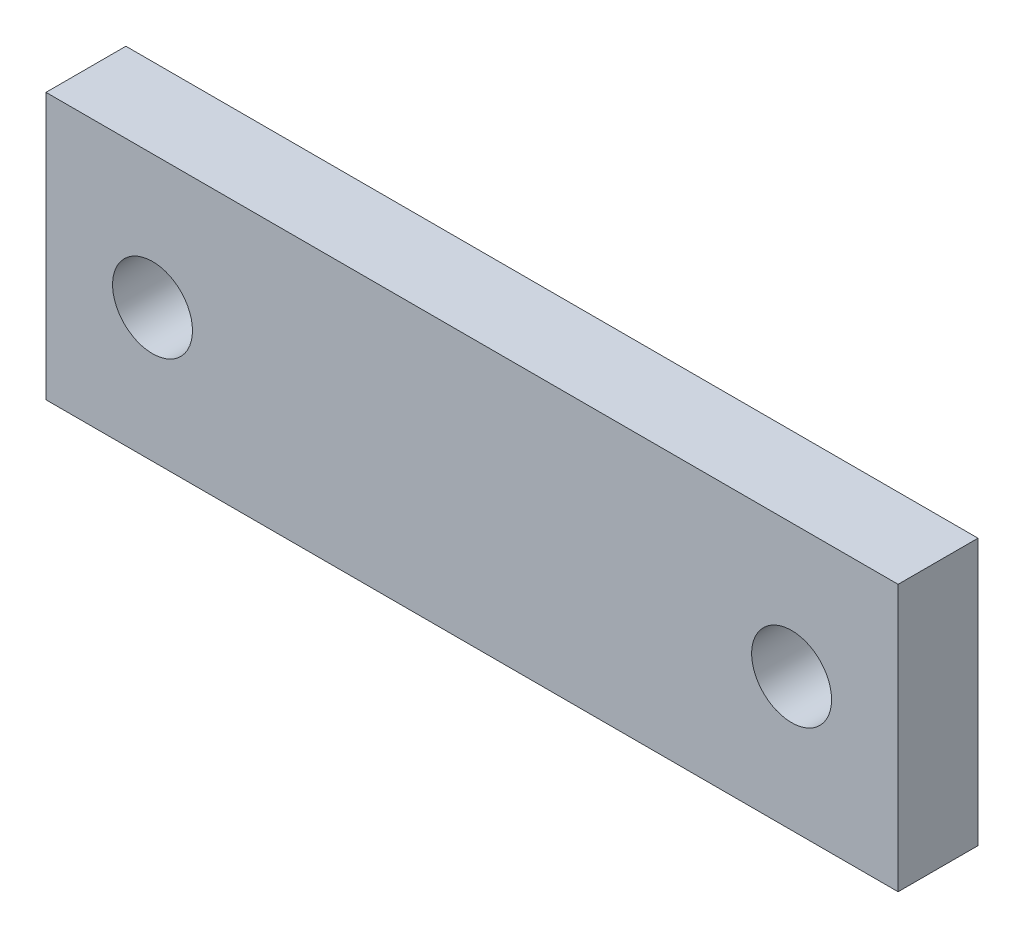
ISO-10303-21;
HEADER;
FILE_DESCRIPTION(('STEP AP214'),'2;1');
FILE_NAME('part.step','',(''),(''),'','','');
FILE_SCHEMA(('AUTOMOTIVE_DESIGN { 1 0 10303 214 1 1 1 1 }'));
ENDSEC;
DATA;
#1=APPLICATION_CONTEXT('core data for automotive mechanical design processes');
#2=APPLICATION_PROTOCOL_DEFINITION('international standard','automotive_design',2000,#1);
#3=PRODUCT_CONTEXT('',#1,'mechanical');
#4=PRODUCT('Part','Part','',(#3));
#5=PRODUCT_RELATED_PRODUCT_CATEGORY('part','',(#4));
#6=PRODUCT_DEFINITION_FORMATION('','',#4);
#7=PRODUCT_DEFINITION_CONTEXT('part definition',#1,'design');
#8=PRODUCT_DEFINITION('design','',#6,#7);
#9=PRODUCT_DEFINITION_SHAPE('','',#8);
#10=(LENGTH_UNIT() NAMED_UNIT(*) SI_UNIT(.MILLI.,.METRE.));
#11=(NAMED_UNIT(*) PLANE_ANGLE_UNIT() SI_UNIT($,.RADIAN.));
#12=(NAMED_UNIT(*) SI_UNIT($,.STERADIAN.) SOLID_ANGLE_UNIT());
#13=UNCERTAINTY_MEASURE_WITH_UNIT(LENGTH_MEASURE(1.E-05),#10,'distance_accuracy_value','');
#14=(GEOMETRIC_REPRESENTATION_CONTEXT(3) GLOBAL_UNCERTAINTY_ASSIGNED_CONTEXT((#13)) GLOBAL_UNIT_ASSIGNED_CONTEXT((#10,
#11,#12)) REPRESENTATION_CONTEXT('',''));
#15=CARTESIAN_POINT('',(0.,0.,0.));
#16=DIRECTION('',(0.,0.,1.));
#17=DIRECTION('',(1.,0.,0.));
#18=AXIS2_PLACEMENT_3D('',#15,#16,#17);
#19=CARTESIAN_POINT('',(0.,0.,-4.7625));
#20=DIRECTION('',(-1.,0.,0.));
#21=DIRECTION('',(0.,0.,1.));
#22=AXIS2_PLACEMENT_3D('',#19,#20,#21);
#23=PLANE('',#22);
#24=DIRECTION('',(0.,-1.,0.));
#25=VECTOR('',#24,1.);
#26=CARTESIAN_POINT('',(0.,0.,4.7625));
#27=LINE('',#26,#25);
#28=CARTESIAN_POINT('',(0.,31.75,4.7625));
#29=VERTEX_POINT('',#28);
#30=CARTESIAN_POINT('',(0.,0.,4.7625));
#31=VERTEX_POINT('',#30);
#32=EDGE_CURVE('E71',#29,#31,#27,.T.);
#33=ORIENTED_EDGE('',*,*,#32,.F.);
#34=DIRECTION('',(0.,0.,1.));
#35=VECTOR('',#34,1.);
#36=CARTESIAN_POINT('',(0.,31.75,-4.7625));
#37=LINE('',#36,#35);
#38=CARTESIAN_POINT('',(0.,31.75,-4.7625));
#39=VERTEX_POINT('',#38);
#40=EDGE_CURVE('E11',#39,#29,#37,.T.);
#41=ORIENTED_EDGE('',*,*,#40,.F.);
#42=DIRECTION('',(0.,-1.,0.));
#43=VECTOR('',#42,1.);
#44=CARTESIAN_POINT('',(0.,0.,-4.7625));
#45=LINE('',#44,#43);
#46=CARTESIAN_POINT('',(0.,0.,-4.7625));
#47=VERTEX_POINT('',#46);
#48=EDGE_CURVE('E73',#39,#47,#45,.T.);
#49=ORIENTED_EDGE('',*,*,#48,.T.);
#50=DIRECTION('',(0.,0.,1.));
#51=VECTOR('',#50,1.);
#52=CARTESIAN_POINT('',(0.,0.,-4.7625));
#53=LINE('',#52,#51);
#54=EDGE_CURVE('E34',#47,#31,#53,.T.);
#55=ORIENTED_EDGE('',*,*,#54,.T.);
#56=EDGE_LOOP('',(#33,#41,#49,#55));
#57=FACE_BOUND('',#56,.T.);
#58=ADVANCED_FACE('F31',(#57),#23,.T.);
#59=CARTESIAN_POINT('',(0.,31.75,-4.7625));
#60=DIRECTION('',(0.,1.,0.));
#61=DIRECTION('',(0.,0.,1.));
#62=AXIS2_PLACEMENT_3D('',#59,#60,#61);
#63=PLANE('',#62);
#64=DIRECTION('',(-1.,0.,0.));
#65=VECTOR('',#64,1.);
#66=CARTESIAN_POINT('',(0.,31.75,4.7625));
#67=LINE('',#66,#65);
#68=CARTESIAN_POINT('',(101.6,31.75,4.7625));
#69=VERTEX_POINT('',#68);
#70=EDGE_CURVE('E88',#69,#29,#67,.T.);
#71=ORIENTED_EDGE('',*,*,#70,.F.);
#72=DIRECTION('',(0.,0.,1.));
#73=VECTOR('',#72,1.);
#74=CARTESIAN_POINT('',(101.6,31.75,-4.7625));
#75=LINE('',#74,#73);
#76=CARTESIAN_POINT('',(101.6,31.75,-4.7625));
#77=VERTEX_POINT('',#76);
#78=EDGE_CURVE('E39',#77,#69,#75,.T.);
#79=ORIENTED_EDGE('',*,*,#78,.F.);
#80=DIRECTION('',(-1.,0.,0.));
#81=VECTOR('',#80,1.);
#82=CARTESIAN_POINT('',(0.,31.75,-4.7625));
#83=LINE('',#82,#81);
#84=EDGE_CURVE('E78',#77,#39,#83,.T.);
#85=ORIENTED_EDGE('',*,*,#84,.T.);
#86=ORIENTED_EDGE('',*,*,#40,.T.);
#87=EDGE_LOOP('',(#71,#79,#85,#86));
#88=FACE_BOUND('',#87,.T.);
#89=ADVANCED_FACE('F108',(#88),#63,.T.);
#90=CARTESIAN_POINT('',(101.6,0.,-4.7625));
#91=DIRECTION('',(1.,0.,0.));
#92=DIRECTION('',(0.,0.,-1.));
#93=AXIS2_PLACEMENT_3D('',#90,#91,#92);
#94=PLANE('',#93);
#95=DIRECTION('',(0.,1.,0.));
#96=VECTOR('',#95,1.);
#97=CARTESIAN_POINT('',(101.6,0.,4.7625));
#98=LINE('',#97,#96);
#99=CARTESIAN_POINT('',(101.6,0.,4.7625));
#100=VERTEX_POINT('',#99);
#101=EDGE_CURVE('E85',#100,#69,#98,.T.);
#102=ORIENTED_EDGE('',*,*,#101,.F.);
#103=DIRECTION('',(0.,0.,1.));
#104=VECTOR('',#103,1.);
#105=CARTESIAN_POINT('',(101.6,0.,-4.7625));
#106=LINE('',#105,#104);
#107=CARTESIAN_POINT('',(101.6,0.,-4.7625));
#108=VERTEX_POINT('',#107);
#109=EDGE_CURVE('E77',#108,#100,#106,.T.);
#110=ORIENTED_EDGE('',*,*,#109,.F.);
#111=DIRECTION('',(0.,1.,0.));
#112=VECTOR('',#111,1.);
#113=CARTESIAN_POINT('',(101.6,0.,-4.7625));
#114=LINE('',#113,#112);
#115=EDGE_CURVE('E101',#108,#77,#114,.T.);
#116=ORIENTED_EDGE('',*,*,#115,.T.);
#117=ORIENTED_EDGE('',*,*,#78,.T.);
#118=EDGE_LOOP('',(#102,#110,#116,#117));
#119=FACE_BOUND('',#118,.T.);
#120=ADVANCED_FACE('F105',(#119),#94,.T.);
#121=CARTESIAN_POINT('',(0.,0.,-4.7625));
#122=DIRECTION('',(0.,-1.,0.));
#123=DIRECTION('',(0.,0.,-1.));
#124=AXIS2_PLACEMENT_3D('',#121,#122,#123);
#125=PLANE('',#124);
#126=DIRECTION('',(1.,0.,0.));
#127=VECTOR('',#126,1.);
#128=CARTESIAN_POINT('',(0.,0.,4.7625));
#129=LINE('',#128,#127);
#130=EDGE_CURVE('E80',#31,#100,#129,.T.);
#131=ORIENTED_EDGE('',*,*,#130,.F.);
#132=ORIENTED_EDGE('',*,*,#54,.F.);
#133=DIRECTION('',(1.,0.,0.));
#134=VECTOR('',#133,1.);
#135=CARTESIAN_POINT('',(0.,0.,-4.7625));
#136=LINE('',#135,#134);
#137=EDGE_CURVE('E99',#47,#108,#136,.T.);
#138=ORIENTED_EDGE('',*,*,#137,.T.);
#139=ORIENTED_EDGE('',*,*,#109,.T.);
#140=EDGE_LOOP('',(#131,#132,#138,#139));
#141=FACE_BOUND('',#140,.T.);
#142=ADVANCED_FACE('F81',(#141),#125,.T.);
#143=CARTESIAN_POINT('',(0.,31.75,-4.7625));
#144=DIRECTION('',(0.,0.,-1.));
#145=DIRECTION('',(-1.,0.,0.));
#146=AXIS2_PLACEMENT_3D('',#143,#144,#145);
#147=PLANE('',#146);
#148=CARTESIAN_POINT('',(88.9,15.875,-4.7625));
#149=DIRECTION('',(0.,0.,1.));
#150=DIRECTION('',(1.,0.,0.));
#151=AXIS2_PLACEMENT_3D('',#148,#149,#150);
#152=CIRCLE('',#151,4.7625);
#153=CARTESIAN_POINT('',(93.6625,15.875,-4.7625));
#154=VERTEX_POINT('',#153);
#155=EDGE_CURVE('E173',#154,#154,#152,.T.);
#156=ORIENTED_EDGE('',*,*,#155,.T.);
#157=EDGE_LOOP('',(#156));
#158=FACE_BOUND('',#157,.T.);
#159=CARTESIAN_POINT('',(12.7,15.875,-4.7625));
#160=DIRECTION('',(0.,0.,1.));
#161=DIRECTION('',(1.,0.,0.));
#162=AXIS2_PLACEMENT_3D('',#159,#160,#161);
#163=CIRCLE('',#162,4.7625);
#164=CARTESIAN_POINT('',(17.4625,15.875,-4.7625));
#165=VERTEX_POINT('',#164);
#166=EDGE_CURVE('E89',#165,#165,#163,.T.);
#167=ORIENTED_EDGE('',*,*,#166,.T.);
#168=EDGE_LOOP('',(#167));
#169=FACE_BOUND('',#168,.T.);
#170=ORIENTED_EDGE('',*,*,#48,.F.);
#171=ORIENTED_EDGE('',*,*,#84,.F.);
#172=ORIENTED_EDGE('',*,*,#115,.F.);
#173=ORIENTED_EDGE('',*,*,#137,.F.);
#174=EDGE_LOOP('',(#170,#171,#172,#173));
#175=FACE_BOUND('',#174,.T.);
#176=ADVANCED_FACE('F110',(#158,#169,#175),#147,.T.);
#177=CARTESIAN_POINT('',(0.,31.75,4.7625));
#178=DIRECTION('',(0.,0.,-1.));
#179=DIRECTION('',(-1.,0.,0.));
#180=AXIS2_PLACEMENT_3D('',#177,#178,#179);
#181=PLANE('',#180);
#182=CARTESIAN_POINT('',(88.9,15.875,4.7625));
#183=DIRECTION('',(0.,0.,1.));
#184=DIRECTION('',(1.,0.,0.));
#185=AXIS2_PLACEMENT_3D('',#182,#183,#184);
#186=CIRCLE('',#185,4.7625);
#187=CARTESIAN_POINT('',(93.6625,15.875,4.7625));
#188=VERTEX_POINT('',#187);
#189=EDGE_CURVE('E176',#188,#188,#186,.T.);
#190=ORIENTED_EDGE('',*,*,#189,.F.);
#191=EDGE_LOOP('',(#190));
#192=FACE_BOUND('',#191,.T.);
#193=CARTESIAN_POINT('',(12.7,15.875,4.7625));
#194=DIRECTION('',(0.,0.,1.));
#195=DIRECTION('',(1.,0.,0.));
#196=AXIS2_PLACEMENT_3D('',#193,#194,#195);
#197=CIRCLE('',#196,4.7625);
#198=CARTESIAN_POINT('',(17.4625,15.875,4.7625));
#199=VERTEX_POINT('',#198);
#200=EDGE_CURVE('E92',#199,#199,#197,.T.);
#201=ORIENTED_EDGE('',*,*,#200,.F.);
#202=EDGE_LOOP('',(#201));
#203=FACE_BOUND('',#202,.T.);
#204=ORIENTED_EDGE('',*,*,#32,.T.);
#205=ORIENTED_EDGE('',*,*,#130,.T.);
#206=ORIENTED_EDGE('',*,*,#101,.T.);
#207=ORIENTED_EDGE('',*,*,#70,.T.);
#208=EDGE_LOOP('',(#204,#205,#206,#207));
#209=FACE_BOUND('',#208,.T.);
#210=ADVANCED_FACE('F87',(#192,#203,#209),#181,.F.);
#211=CARTESIAN_POINT('',(12.7,15.875,-4.7625));
#212=DIRECTION('',(0.,0.,1.));
#213=DIRECTION('',(1.,0.,0.));
#214=AXIS2_PLACEMENT_3D('',#211,#212,#213);
#215=CYLINDRICAL_SURFACE('',#214,4.7625);
#216=CARTESIAN_POINT('',(17.4625,15.875,-4.7625));
#217=CARTESIAN_POINT('',(17.4625,15.875,-4.66328125));
#218=CARTESIAN_POINT('',(17.4625,15.875,-4.5640625));
#219=CARTESIAN_POINT('',(17.4625,15.875,-4.365625));
#220=CARTESIAN_POINT('',(17.4625,15.875,-4.26640625));
#221=CARTESIAN_POINT('',(17.4625,15.875,-4.06796875));
#222=CARTESIAN_POINT('',(17.4625,15.875,-3.96875));
#223=CARTESIAN_POINT('',(17.4625,15.875,-3.7703125));
#224=CARTESIAN_POINT('',(17.4625,15.875,-3.67109375));
#225=CARTESIAN_POINT('',(17.4625,15.875,-3.47265625));
#226=CARTESIAN_POINT('',(17.4625,15.875,-3.3734375));
#227=CARTESIAN_POINT('',(17.4625,15.875,-3.175));
#228=CARTESIAN_POINT('',(17.4625,15.875,-3.07578125));
#229=CARTESIAN_POINT('',(17.4625,15.875,-2.87734375));
#230=CARTESIAN_POINT('',(17.4625,15.875,-2.778125));
#231=CARTESIAN_POINT('',(17.4625,15.875,-2.5796875));
#232=CARTESIAN_POINT('',(17.4625,15.875,-2.48046875));
#233=CARTESIAN_POINT('',(17.4625,15.875,-2.28203125));
#234=CARTESIAN_POINT('',(17.4625,15.875,-2.1828125));
#235=CARTESIAN_POINT('',(17.4625,15.875,-1.984375));
#236=CARTESIAN_POINT('',(17.4625,15.875,-1.88515625));
#237=CARTESIAN_POINT('',(17.4625,15.875,-1.68671875));
#238=CARTESIAN_POINT('',(17.4625,15.875,-1.5875));
#239=CARTESIAN_POINT('',(17.4625,15.875,-1.3890625));
#240=CARTESIAN_POINT('',(17.4625,15.875,-1.28984375));
#241=CARTESIAN_POINT('',(17.4625,15.875,-1.09140625));
#242=CARTESIAN_POINT('',(17.4625,15.875,-0.9921875));
#243=CARTESIAN_POINT('',(17.4625,15.875,-0.79375));
#244=CARTESIAN_POINT('',(17.4625,15.875,-0.69453125));
#245=CARTESIAN_POINT('',(17.4625,15.875,-0.49609375));
#246=CARTESIAN_POINT('',(17.4625,15.875,-0.396875));
#247=CARTESIAN_POINT('',(17.4625,15.875,-0.1984375));
#248=CARTESIAN_POINT('',(17.4625,15.875,-0.0992187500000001));
#249=CARTESIAN_POINT('',(17.4625,15.875,0.0992187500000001));
#250=CARTESIAN_POINT('',(17.4625,15.875,0.1984375));
#251=CARTESIAN_POINT('',(17.4625,15.875,0.396875));
#252=CARTESIAN_POINT('',(17.4625,15.875,0.49609375));
#253=CARTESIAN_POINT('',(17.4625,15.875,0.69453125));
#254=CARTESIAN_POINT('',(17.4625,15.875,0.793750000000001));
#255=CARTESIAN_POINT('',(17.4625,15.875,0.992187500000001));
#256=CARTESIAN_POINT('',(17.4625,15.875,1.09140625));
#257=CARTESIAN_POINT('',(17.4625,15.875,1.28984375));
#258=CARTESIAN_POINT('',(17.4625,15.875,1.3890625));
#259=CARTESIAN_POINT('',(17.4625,15.875,1.5875));
#260=CARTESIAN_POINT('',(17.4625,15.875,1.68671875));
#261=CARTESIAN_POINT('',(17.4625,15.875,1.88515625));
#262=CARTESIAN_POINT('',(17.4625,15.875,1.984375));
#263=CARTESIAN_POINT('',(17.4625,15.875,2.1828125));
#264=CARTESIAN_POINT('',(17.4625,15.875,2.28203125));
#265=CARTESIAN_POINT('',(17.4625,15.875,2.48046875));
#266=CARTESIAN_POINT('',(17.4625,15.875,2.5796875));
#267=CARTESIAN_POINT('',(17.4625,15.875,2.778125));
#268=CARTESIAN_POINT('',(17.4625,15.875,2.87734375));
#269=CARTESIAN_POINT('',(17.4625,15.875,3.07578125));
#270=CARTESIAN_POINT('',(17.4625,15.875,3.175));
#271=CARTESIAN_POINT('',(17.4625,15.875,3.3734375));
#272=CARTESIAN_POINT('',(17.4625,15.875,3.47265625));
#273=CARTESIAN_POINT('',(17.4625,15.875,3.67109375));
#274=CARTESIAN_POINT('',(17.4625,15.875,3.7703125));
#275=CARTESIAN_POINT('',(17.4625,15.875,3.96875));
#276=CARTESIAN_POINT('',(17.4625,15.875,4.06796875));
#277=CARTESIAN_POINT('',(17.4625,15.875,4.26640625));
#278=CARTESIAN_POINT('',(17.4625,15.875,4.365625));
#279=CARTESIAN_POINT('',(17.4625,15.875,4.5640625));
#280=CARTESIAN_POINT('',(17.4625,15.875,4.66328125));
#281=CARTESIAN_POINT('',(17.4625,15.875,4.7625));
#282=B_SPLINE_CURVE_WITH_KNOTS('',3,(#216,#217,#218,#219,#220,#221,#222,#223,#224,#225,#226,
#227,#228,#229,#230,#231,#232,#233,#234,#235,#236,#237,#238,#239,#240,#241,#242,#243,#244,#245,
#246,#247,#248,#249,#250,#251,#252,#253,#254,#255,#256,#257,#258,#259,#260,#261,#262,#263,#264,
#265,#266,#267,#268,#269,#270,#271,#272,#273,#274,#275,#276,#277,#278,#279,#280,#281),
.UNSPECIFIED.,.F.,.F.,(4,2,2,2,2,2,2,2,2,2,2,2,2,2,2,2,2,2,2,2,2,2,2,2,2,2,2,2,2,2,2,2,4),(0.,
0.297656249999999,0.595312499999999,0.89296875,1.190625,1.48828125,1.7859375,2.08359375,2.38125,
2.67890625,2.9765625,3.27421875,3.571875,3.86953125,4.1671875,4.46484375,4.7625,5.06015625,
5.3578125,5.65546875,5.953125,6.25078125,6.5484375,6.84609375,7.14375,7.44140625,7.7390625,
8.03671875,8.334375,8.63203125,8.9296875,9.22734375,9.525),.UNSPECIFIED.);
#283=EDGE_CURVE('BSEAM118',#165,#199,#282,.T.);
#284=ORIENTED_EDGE('',*,*,#166,.F.);
#285=ORIENTED_EDGE('',*,*,#200,.T.);
#286=ORIENTED_EDGE('',*,*,#283,.T.);
#287=ORIENTED_EDGE('',*,*,#283,.F.);
#288=EDGE_LOOP('',(#284,#286,#285,#287));
#289=FACE_BOUND('',#288,.T.);
#290=ADVANCED_FACE('F118',(#289),#215,.F.);
#291=CARTESIAN_POINT('',(88.9,15.875,-4.7625));
#292=DIRECTION('',(0.,0.,1.));
#293=DIRECTION('',(1.,0.,0.));
#294=AXIS2_PLACEMENT_3D('',#291,#292,#293);
#295=CYLINDRICAL_SURFACE('',#294,4.7625);
#296=CARTESIAN_POINT('',(93.6625,15.875,-4.7625));
#297=CARTESIAN_POINT('',(93.6625,15.875,-4.66328125));
#298=CARTESIAN_POINT('',(93.6625,15.875,-4.5640625));
#299=CARTESIAN_POINT('',(93.6625,15.875,-4.365625));
#300=CARTESIAN_POINT('',(93.6625,15.875,-4.26640625));
#301=CARTESIAN_POINT('',(93.6625,15.875,-4.06796875));
#302=CARTESIAN_POINT('',(93.6625,15.875,-3.96875));
#303=CARTESIAN_POINT('',(93.6625,15.875,-3.7703125));
#304=CARTESIAN_POINT('',(93.6625,15.875,-3.67109375));
#305=CARTESIAN_POINT('',(93.6625,15.875,-3.47265625));
#306=CARTESIAN_POINT('',(93.6625,15.875,-3.3734375));
#307=CARTESIAN_POINT('',(93.6625,15.875,-3.175));
#308=CARTESIAN_POINT('',(93.6625,15.875,-3.07578125));
#309=CARTESIAN_POINT('',(93.6625,15.875,-2.87734375));
#310=CARTESIAN_POINT('',(93.6625,15.875,-2.778125));
#311=CARTESIAN_POINT('',(93.6625,15.875,-2.5796875));
#312=CARTESIAN_POINT('',(93.6625,15.875,-2.48046875));
#313=CARTESIAN_POINT('',(93.6625,15.875,-2.28203125));
#314=CARTESIAN_POINT('',(93.6625,15.875,-2.1828125));
#315=CARTESIAN_POINT('',(93.6625,15.875,-1.984375));
#316=CARTESIAN_POINT('',(93.6625,15.875,-1.88515625));
#317=CARTESIAN_POINT('',(93.6625,15.875,-1.68671875));
#318=CARTESIAN_POINT('',(93.6625,15.875,-1.5875));
#319=CARTESIAN_POINT('',(93.6625,15.875,-1.3890625));
#320=CARTESIAN_POINT('',(93.6625,15.875,-1.28984375));
#321=CARTESIAN_POINT('',(93.6625,15.875,-1.09140625));
#322=CARTESIAN_POINT('',(93.6625,15.875,-0.9921875));
#323=CARTESIAN_POINT('',(93.6625,15.875,-0.79375));
#324=CARTESIAN_POINT('',(93.6625,15.875,-0.69453125));
#325=CARTESIAN_POINT('',(93.6625,15.875,-0.49609375));
#326=CARTESIAN_POINT('',(93.6625,15.875,-0.396875));
#327=CARTESIAN_POINT('',(93.6625,15.875,-0.1984375));
#328=CARTESIAN_POINT('',(93.6625,15.875,-0.0992187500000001));
#329=CARTESIAN_POINT('',(93.6625,15.875,0.0992187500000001));
#330=CARTESIAN_POINT('',(93.6625,15.875,0.1984375));
#331=CARTESIAN_POINT('',(93.6625,15.875,0.396875));
#332=CARTESIAN_POINT('',(93.6625,15.875,0.49609375));
#333=CARTESIAN_POINT('',(93.6625,15.875,0.69453125));
#334=CARTESIAN_POINT('',(93.6625,15.875,0.793750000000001));
#335=CARTESIAN_POINT('',(93.6625,15.875,0.992187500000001));
#336=CARTESIAN_POINT('',(93.6625,15.875,1.09140625));
#337=CARTESIAN_POINT('',(93.6625,15.875,1.28984375));
#338=CARTESIAN_POINT('',(93.6625,15.875,1.3890625));
#339=CARTESIAN_POINT('',(93.6625,15.875,1.5875));
#340=CARTESIAN_POINT('',(93.6625,15.875,1.68671875));
#341=CARTESIAN_POINT('',(93.6625,15.875,1.88515625));
#342=CARTESIAN_POINT('',(93.6625,15.875,1.984375));
#343=CARTESIAN_POINT('',(93.6625,15.875,2.1828125));
#344=CARTESIAN_POINT('',(93.6625,15.875,2.28203125));
#345=CARTESIAN_POINT('',(93.6625,15.875,2.48046875));
#346=CARTESIAN_POINT('',(93.6625,15.875,2.5796875));
#347=CARTESIAN_POINT('',(93.6625,15.875,2.778125));
#348=CARTESIAN_POINT('',(93.6625,15.875,2.87734375));
#349=CARTESIAN_POINT('',(93.6625,15.875,3.07578125));
#350=CARTESIAN_POINT('',(93.6625,15.875,3.175));
#351=CARTESIAN_POINT('',(93.6625,15.875,3.3734375));
#352=CARTESIAN_POINT('',(93.6625,15.875,3.47265625));
#353=CARTESIAN_POINT('',(93.6625,15.875,3.67109375));
#354=CARTESIAN_POINT('',(93.6625,15.875,3.7703125));
#355=CARTESIAN_POINT('',(93.6625,15.875,3.96875));
#356=CARTESIAN_POINT('',(93.6625,15.875,4.06796875));
#357=CARTESIAN_POINT('',(93.6625,15.875,4.26640625));
#358=CARTESIAN_POINT('',(93.6625,15.875,4.365625));
#359=CARTESIAN_POINT('',(93.6625,15.875,4.5640625));
#360=CARTESIAN_POINT('',(93.6625,15.875,4.66328125));
#361=CARTESIAN_POINT('',(93.6625,15.875,4.7625));
#362=B_SPLINE_CURVE_WITH_KNOTS('',3,(#296,#297,#298,#299,#300,#301,#302,#303,#304,#305,#306,
#307,#308,#309,#310,#311,#312,#313,#314,#315,#316,#317,#318,#319,#320,#321,#322,#323,#324,#325,
#326,#327,#328,#329,#330,#331,#332,#333,#334,#335,#336,#337,#338,#339,#340,#341,#342,#343,#344,
#345,#346,#347,#348,#349,#350,#351,#352,#353,#354,#355,#356,#357,#358,#359,#360,#361),
.UNSPECIFIED.,.F.,.F.,(4,2,2,2,2,2,2,2,2,2,2,2,2,2,2,2,2,2,2,2,2,2,2,2,2,2,2,2,2,2,2,2,4),(0.,
0.297656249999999,0.595312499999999,0.89296875,1.190625,1.48828125,1.7859375,2.08359375,2.38125,
2.67890625,2.9765625,3.27421875,3.571875,3.86953125,4.1671875,4.46484375,4.7625,5.06015625,
5.3578125,5.65546875,5.953125,6.25078125,6.5484375,6.84609375,7.14375,7.44140625,7.7390625,
8.03671875,8.334375,8.63203125,8.9296875,9.22734375,9.525),.UNSPECIFIED.);
#363=EDGE_CURVE('BSEAM157',#154,#188,#362,.T.);
#364=ORIENTED_EDGE('',*,*,#155,.F.);
#365=ORIENTED_EDGE('',*,*,#189,.T.);
#366=ORIENTED_EDGE('',*,*,#363,.T.);
#367=ORIENTED_EDGE('',*,*,#363,.F.);
#368=EDGE_LOOP('',(#364,#366,#365,#367));
#369=FACE_BOUND('',#368,.T.);
#370=ADVANCED_FACE('F157',(#369),#295,.F.);
#371=CLOSED_SHELL('',(#58,#89,#120,#142,#176,#210,#290,#370));
#372=MANIFOLD_SOLID_BREP('B2',#371);
#373=ADVANCED_BREP_SHAPE_REPRESENTATION('',(#18,#372),#14);
#374=SHAPE_DEFINITION_REPRESENTATION(#9,#373);
ENDSEC;
END-ISO-10303-21;
